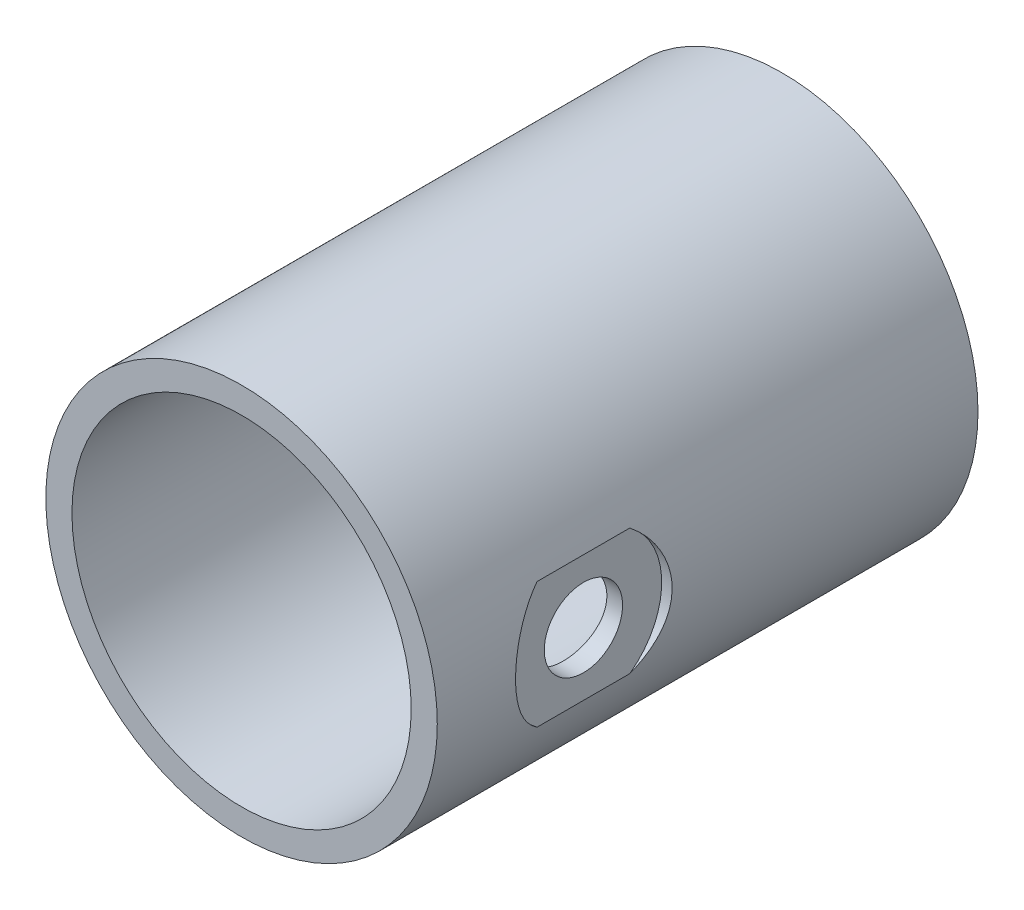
ISO-10303-21;
HEADER;
FILE_DESCRIPTION(('STEP AP214'),'2;1');
FILE_NAME('part.step','',(''),(''),'','','');
FILE_SCHEMA(('AUTOMOTIVE_DESIGN { 1 0 10303 214 1 1 1 1 }'));
ENDSEC;
DATA;
#1=APPLICATION_CONTEXT('core data for automotive mechanical design processes');
#2=APPLICATION_PROTOCOL_DEFINITION('international standard','automotive_design',2000,#1);
#3=PRODUCT_CONTEXT('',#1,'mechanical');
#4=PRODUCT('Part','Part','',(#3));
#5=PRODUCT_RELATED_PRODUCT_CATEGORY('part','',(#4));
#6=PRODUCT_DEFINITION_FORMATION('','',#4);
#7=PRODUCT_DEFINITION_CONTEXT('part definition',#1,'design');
#8=PRODUCT_DEFINITION('design','',#6,#7);
#9=PRODUCT_DEFINITION_SHAPE('','',#8);
#10=(LENGTH_UNIT() NAMED_UNIT(*) SI_UNIT(.MILLI.,.METRE.));
#11=(NAMED_UNIT(*) PLANE_ANGLE_UNIT() SI_UNIT($,.RADIAN.));
#12=(NAMED_UNIT(*) SI_UNIT($,.STERADIAN.) SOLID_ANGLE_UNIT());
#13=UNCERTAINTY_MEASURE_WITH_UNIT(LENGTH_MEASURE(1.E-05),#10,'distance_accuracy_value','');
#14=(GEOMETRIC_REPRESENTATION_CONTEXT(3) GLOBAL_UNCERTAINTY_ASSIGNED_CONTEXT((#13)) GLOBAL_UNIT_ASSIGNED_CONTEXT((#10,
#11,#12)) REPRESENTATION_CONTEXT('',''));
#15=CARTESIAN_POINT('',(0.,0.,0.));
#16=DIRECTION('',(0.,0.,1.));
#17=DIRECTION('',(1.,0.,0.));
#18=AXIS2_PLACEMENT_3D('',#15,#16,#17);
#19=CARTESIAN_POINT('',(0.,0.,263.144));
#20=DIRECTION('',(0.,0.,1.));
#21=DIRECTION('',(1.,0.,0.));
#22=AXIS2_PLACEMENT_3D('',#19,#20,#21);
#23=PLANE('',#22);
#24=CARTESIAN_POINT('',(0.,0.,263.144));
#25=DIRECTION('',(0.,0.,1.));
#26=DIRECTION('',(1.,0.,0.));
#27=AXIS2_PLACEMENT_3D('',#24,#25,#26);
#28=CIRCLE('',#27,95.25);
#29=CARTESIAN_POINT('',(95.25,0.,263.144));
#30=VERTEX_POINT('',#29);
#31=EDGE_CURVE('E75',#30,#30,#28,.T.);
#32=ORIENTED_EDGE('',*,*,#31,.T.);
#33=EDGE_LOOP('',(#32));
#34=FACE_BOUND('',#33,.T.);
#35=CARTESIAN_POINT('',(0.,0.,263.144));
#36=DIRECTION('',(0.,0.,1.));
#37=DIRECTION('',(1.,0.,0.));
#38=AXIS2_PLACEMENT_3D('',#35,#36,#37);
#39=CIRCLE('',#38,82.55);
#40=CARTESIAN_POINT('',(82.55,0.,263.144));
#41=VERTEX_POINT('',#40);
#42=EDGE_CURVE('E126',#41,#41,#39,.T.);
#43=ORIENTED_EDGE('',*,*,#42,.F.);
#44=EDGE_LOOP('',(#43));
#45=FACE_BOUND('',#44,.T.);
#46=ADVANCED_FACE('F35',(#34,#45),#23,.T.);
#47=CARTESIAN_POINT('',(0.,0.,0.));
#48=DIRECTION('',(0.,0.,1.));
#49=DIRECTION('',(1.,0.,0.));
#50=AXIS2_PLACEMENT_3D('',#47,#48,#49);
#51=PLANE('',#50);
#52=CARTESIAN_POINT('',(0.,0.,0.));
#53=DIRECTION('',(0.,0.,1.));
#54=DIRECTION('',(1.,0.,0.));
#55=AXIS2_PLACEMENT_3D('',#52,#53,#54);
#56=CIRCLE('',#55,95.25);
#57=CARTESIAN_POINT('',(95.25,0.,0.));
#58=VERTEX_POINT('',#57);
#59=EDGE_CURVE('E128',#58,#58,#56,.T.);
#60=ORIENTED_EDGE('',*,*,#59,.F.);
#61=EDGE_LOOP('',(#60));
#62=FACE_BOUND('',#61,.T.);
#63=CARTESIAN_POINT('',(0.,0.,0.));
#64=DIRECTION('',(0.,0.,1.));
#65=DIRECTION('',(1.,0.,0.));
#66=AXIS2_PLACEMENT_3D('',#63,#64,#65);
#67=CIRCLE('',#66,82.55);
#68=CARTESIAN_POINT('',(82.55,0.,0.));
#69=VERTEX_POINT('',#68);
#70=EDGE_CURVE('E71',#69,#69,#67,.T.);
#71=ORIENTED_EDGE('',*,*,#70,.T.);
#72=EDGE_LOOP('',(#71));
#73=FACE_BOUND('',#72,.T.);
#74=ADVANCED_FACE('F97',(#62,#73),#51,.F.);
#75=CARTESIAN_POINT('',(0.,0.,263.144));
#76=DIRECTION('',(0.,0.,-1.));
#77=DIRECTION('',(-1.,0.,0.));
#78=AXIS2_PLACEMENT_3D('',#75,#76,#77);
#79=CYLINDRICAL_SURFACE('',#78,95.25);
#80=DIRECTION('',(0.,0.,-1.));
#81=VECTOR('',#80,1.);
#82=CARTESIAN_POINT('',(90.17,-30.6909367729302,263.144));
#83=LINE('',#82,#81);
#84=CARTESIAN_POINT('',(90.17,-30.6909367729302,209.520013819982));
#85=VERTEX_POINT('',#84);
#86=CARTESIAN_POINT('',(90.17,-30.6909367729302,164.367986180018));
#87=VERTEX_POINT('',#86);
#88=EDGE_CURVE('E11',#85,#87,#83,.T.);
#89=ORIENTED_EDGE('',*,*,#88,.F.);
#90=CARTESIAN_POINT('',(90.17,-30.6909367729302,209.520013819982));
#91=CARTESIAN_POINT('',(90.3877588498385,-30.0512307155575,210.38972627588));
#92=CARTESIAN_POINT('',(90.6102774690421,-29.3750954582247,211.231389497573));
#93=CARTESIAN_POINT('',(91.0586055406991,-27.9543642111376,212.853951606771));
#94=CARTESIAN_POINT('',(91.2844151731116,-27.2097644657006,213.634847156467));
#95=CARTESIAN_POINT('',(91.7335438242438,-25.6549372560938,215.132687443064));
#96=CARTESIAN_POINT('',(91.9568565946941,-24.8445748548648,215.849494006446));
#97=CARTESIAN_POINT('',(92.3944188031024,-23.1643540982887,217.212678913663));
#98=CARTESIAN_POINT('',(92.6086684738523,-22.2944972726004,217.859059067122));
#99=CARTESIAN_POINT('',(93.0225428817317,-20.4992332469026,219.077625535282));
#100=CARTESIAN_POINT('',(93.2221482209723,-19.5737552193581,219.6497141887));
#101=CARTESIAN_POINT('',(93.6009112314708,-17.6739890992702,220.714187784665));
#102=CARTESIAN_POINT('',(93.7800686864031,-16.6997004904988,221.206571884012));
#103=CARTESIAN_POINT('',(94.1126811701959,-14.7099246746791,222.106750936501));
#104=CARTESIAN_POINT('',(94.2661657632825,-13.6944865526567,222.514643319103));
#105=CARTESIAN_POINT('',(94.5432361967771,-11.6286201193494,223.242545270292));
#106=CARTESIAN_POINT('',(94.6668235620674,-10.5781935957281,223.56255932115));
#107=CARTESIAN_POINT('',(94.876184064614,-8.49272824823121,224.100381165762));
#108=CARTESIAN_POINT('',(94.9632652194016,-7.45873793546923,224.321746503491));
#109=CARTESIAN_POINT('',(95.1040346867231,-5.37370167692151,224.677960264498));
#110=CARTESIAN_POINT('',(95.157723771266,-4.32265612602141,224.812810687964));
#111=CARTESIAN_POINT('',(95.2301723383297,-2.21179222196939,224.994495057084));
#112=CARTESIAN_POINT('',(95.2489321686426,-1.1519739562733,225.041329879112));
#113=CARTESIAN_POINT('',(95.2509788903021,0.967890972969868,225.046447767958));
#114=CARTESIAN_POINT('',(95.2342670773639,2.02793762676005,225.004734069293));
#115=CARTESIAN_POINT('',(95.1677705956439,4.08086510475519,224.838028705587));
#116=CARTESIAN_POINT('',(95.1198795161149,5.07419888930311,224.717803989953));
#117=CARTESIAN_POINT('',(94.9941384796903,7.04645131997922,224.400042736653));
#118=CARTESIAN_POINT('',(94.9162897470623,8.02537055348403,224.202509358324));
#119=CARTESIAN_POINT('',(94.7325895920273,9.96219641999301,223.73201273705));
#120=CARTESIAN_POINT('',(94.6267380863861,10.9201029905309,223.4590492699));
#121=CARTESIAN_POINT('',(94.3896364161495,12.8087859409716,222.84013653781));
#122=CARTESIAN_POINT('',(94.2583858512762,13.739561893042,222.49418612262));
#123=CARTESIAN_POINT('',(93.9713970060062,15.5827684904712,221.726176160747));
#124=CARTESIAN_POINT('',(93.8153064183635,16.4946812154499,221.303006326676));
#125=CARTESIAN_POINT('',(93.4839288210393,18.2795402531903,220.387600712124));
#126=CARTESIAN_POINT('',(93.3086407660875,19.1524844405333,219.895361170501));
#127=CARTESIAN_POINT('',(92.9430074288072,20.8546842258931,218.845290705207));
#128=CARTESIAN_POINT('',(92.7526613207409,21.6839374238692,218.28745618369));
#129=CARTESIAN_POINT('',(92.3613573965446,23.2943915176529,217.109810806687));
#130=CARTESIAN_POINT('',(92.1604012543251,24.0755999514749,216.490009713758));
#131=CARTESIAN_POINT('',(91.8088338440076,25.3775794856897,215.371246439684));
#132=CARTESIAN_POINT('',(91.6596349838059,25.9107232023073,214.886145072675));
#133=CARTESIAN_POINT('',(91.3599175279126,26.9484614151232,213.886703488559));
#134=CARTESIAN_POINT('',(91.2093990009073,27.4530573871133,213.372364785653));
#135=CARTESIAN_POINT('',(90.9091996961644,28.4313412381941,212.316928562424));
#136=CARTESIAN_POINT('',(90.7595178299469,28.9050908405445,211.775888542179));
#137=CARTESIAN_POINT('',(90.4625153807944,29.8216039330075,210.667392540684));
#138=CARTESIAN_POINT('',(90.3151952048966,30.2643621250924,210.099932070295));
#139=CARTESIAN_POINT('',(90.17,30.6909367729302,209.520013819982));
#140=B_SPLINE_CURVE_WITH_KNOTS('',3,(#90,#91,#92,#93,#94,#95,#96,#97,#98,#99,#100,#101,#102,
#103,#104,#105,#106,#107,#108,#109,#110,#111,#112,#113,#114,#115,#116,#117,#118,#119,#120,#121,
#122,#123,#124,#125,#126,#127,#128,#129,#130,#131,#132,#133,#134,#135,#136,#137,#138,#139),
.UNSPECIFIED.,.F.,.F.,(4,2,2,2,2,2,2,2,2,2,2,2,2,2,2,2,2,2,2,2,2,2,2,2,4),(0.,3.30311891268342,
6.60641912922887,9.9166775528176,13.2268508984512,16.5413325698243,19.8558493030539,
23.1665224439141,26.4770266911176,29.6559173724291,32.8347345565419,36.0135200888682,
39.192189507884,42.1938449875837,45.1953778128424,48.1969195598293,51.1985086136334,
54.2472523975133,57.296162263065,60.3452394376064,63.3938369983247,65.6010438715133,
67.808136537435,70.0106677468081,72.2135745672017),.UNSPECIFIED.);
#141=CARTESIAN_POINT('',(90.17,30.6909367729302,209.520013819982));
#142=VERTEX_POINT('',#141);
#143=EDGE_CURVE('E68',#85,#142,#140,.T.);
#144=ORIENTED_EDGE('',*,*,#143,.T.);
#145=DIRECTION('',(0.,0.,-1.));
#146=VECTOR('',#145,1.);
#147=CARTESIAN_POINT('',(90.17,30.6909367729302,263.144));
#148=LINE('',#147,#146);
#149=CARTESIAN_POINT('',(90.17,30.6909367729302,164.367986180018));
#150=VERTEX_POINT('',#149);
#151=EDGE_CURVE('E44',#150,#142,#148,.F.);
#152=ORIENTED_EDGE('',*,*,#151,.F.);
#153=CARTESIAN_POINT('',(90.17,30.6909367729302,164.367986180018));
#154=CARTESIAN_POINT('',(90.3877588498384,30.0512307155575,163.49827372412));
#155=CARTESIAN_POINT('',(90.610277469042,29.3750954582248,162.656610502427));
#156=CARTESIAN_POINT('',(91.058605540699,27.9543642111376,161.034048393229));
#157=CARTESIAN_POINT('',(91.2844151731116,27.2097644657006,160.253152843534));
#158=CARTESIAN_POINT('',(91.7335438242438,25.6549372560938,158.755312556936));
#159=CARTESIAN_POINT('',(91.9568565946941,24.8445748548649,158.038505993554));
#160=CARTESIAN_POINT('',(92.3944188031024,23.1643540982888,156.675321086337));
#161=CARTESIAN_POINT('',(92.6086684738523,22.2944972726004,156.028940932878));
#162=CARTESIAN_POINT('',(93.0225428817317,20.4992332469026,154.810374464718));
#163=CARTESIAN_POINT('',(93.2221482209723,19.5737552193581,154.2382858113));
#164=CARTESIAN_POINT('',(93.6009112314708,17.6739890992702,153.173812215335));
#165=CARTESIAN_POINT('',(93.7800686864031,16.6997004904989,152.681428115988));
#166=CARTESIAN_POINT('',(94.1126811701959,14.7099246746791,151.7812490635));
#167=CARTESIAN_POINT('',(94.2661657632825,13.6944865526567,151.373356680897));
#168=CARTESIAN_POINT('',(94.543236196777,11.6286201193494,150.645454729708));
#169=CARTESIAN_POINT('',(94.6668235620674,10.5781935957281,150.32544067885));
#170=CARTESIAN_POINT('',(94.876184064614,8.49272824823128,149.787618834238));
#171=CARTESIAN_POINT('',(94.9632652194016,7.4587379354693,149.566253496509));
#172=CARTESIAN_POINT('',(95.1040346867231,5.37370167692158,149.210039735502));
#173=CARTESIAN_POINT('',(95.157723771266,4.32265612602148,149.075189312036));
#174=CARTESIAN_POINT('',(95.2301723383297,2.21179222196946,148.893504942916));
#175=CARTESIAN_POINT('',(95.2489321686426,1.15197395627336,148.846670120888));
#176=CARTESIAN_POINT('',(95.2509788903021,-0.967890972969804,148.841552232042));
#177=CARTESIAN_POINT('',(95.2342670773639,-2.02793762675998,148.883265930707));
#178=CARTESIAN_POINT('',(95.1677705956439,-4.08086510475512,149.049971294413));
#179=CARTESIAN_POINT('',(95.1198795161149,-5.07419888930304,149.170196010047));
#180=CARTESIAN_POINT('',(94.9941384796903,-7.04645131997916,149.487957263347));
#181=CARTESIAN_POINT('',(94.9162897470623,-8.02537055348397,149.685490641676));
#182=CARTESIAN_POINT('',(94.7325895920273,-9.96219641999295,150.15598726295));
#183=CARTESIAN_POINT('',(94.6267380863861,-10.9201029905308,150.4289507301));
#184=CARTESIAN_POINT('',(94.3896364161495,-12.8087859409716,151.04786346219));
#185=CARTESIAN_POINT('',(94.2583858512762,-13.7395618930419,151.39381387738));
#186=CARTESIAN_POINT('',(93.9713970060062,-15.5827684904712,152.161823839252));
#187=CARTESIAN_POINT('',(93.8153064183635,-16.4946812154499,152.584993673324));
#188=CARTESIAN_POINT('',(93.4839288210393,-18.2795402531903,153.500399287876));
#189=CARTESIAN_POINT('',(93.3086407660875,-19.1524844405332,153.992638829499));
#190=CARTESIAN_POINT('',(92.9430074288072,-20.8546842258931,155.042709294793));
#191=CARTESIAN_POINT('',(92.7526613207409,-21.6839374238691,155.60054381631));
#192=CARTESIAN_POINT('',(92.3613573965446,-23.2943915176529,156.778189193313));
#193=CARTESIAN_POINT('',(92.1604012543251,-24.0755999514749,157.397990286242));
#194=CARTESIAN_POINT('',(91.8088338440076,-25.3775794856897,158.516753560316));
#195=CARTESIAN_POINT('',(91.659634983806,-25.9107232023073,159.001854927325));
#196=CARTESIAN_POINT('',(91.3599175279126,-26.9484614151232,160.001296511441));
#197=CARTESIAN_POINT('',(91.2093990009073,-27.4530573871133,160.515635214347));
#198=CARTESIAN_POINT('',(90.9091996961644,-28.4313412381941,161.571071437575));
#199=CARTESIAN_POINT('',(90.7595178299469,-28.9050908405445,162.112111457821));
#200=CARTESIAN_POINT('',(90.4625153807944,-29.8216039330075,163.220607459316));
#201=CARTESIAN_POINT('',(90.3151952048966,-30.2643621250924,163.788067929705));
#202=CARTESIAN_POINT('',(90.17,-30.6909367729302,164.367986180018));
#203=B_SPLINE_CURVE_WITH_KNOTS('',3,(#153,#154,#155,#156,#157,#158,#159,#160,#161,#162,#163,
#164,#165,#166,#167,#168,#169,#170,#171,#172,#173,#174,#175,#176,#177,#178,#179,#180,#181,#182,
#183,#184,#185,#186,#187,#188,#189,#190,#191,#192,#193,#194,#195,#196,#197,#198,#199,#200,#201,
#202),.UNSPECIFIED.,.F.,.F.,(4,2,2,2,2,2,2,2,2,2,2,2,2,2,2,2,2,2,2,2,2,2,2,2,4),(0.,
3.30311891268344,6.60641912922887,9.91667755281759,13.2268508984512,16.5413325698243,
19.8558493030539,23.1665224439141,26.4770266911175,29.6559173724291,32.8347345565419,
36.0135200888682,39.192189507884,42.1938449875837,45.1953778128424,48.1969195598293,
51.1985086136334,54.2472523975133,57.296162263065,60.3452394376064,63.3938369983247,
65.6010438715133,67.808136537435,70.0106677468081,72.2135745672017),.UNSPECIFIED.);
#204=EDGE_CURVE('E50',#150,#87,#203,.T.);
#205=ORIENTED_EDGE('',*,*,#204,.T.);
#206=EDGE_LOOP('',(#89,#144,#152,#205));
#207=FACE_BOUND('',#206,.T.);
#208=ORIENTED_EDGE('',*,*,#31,.F.);
#209=EDGE_LOOP('',(#208));
#210=FACE_BOUND('',#209,.T.);
#211=ORIENTED_EDGE('',*,*,#59,.T.);
#212=EDGE_LOOP('',(#211));
#213=FACE_BOUND('',#212,.T.);
#214=ADVANCED_FACE('F37',(#207,#210,#213),#79,.T.);
#215=CARTESIAN_POINT('',(0.,0.,263.144));
#216=DIRECTION('',(0.,0.,-1.));
#217=DIRECTION('',(-1.,0.,0.));
#218=AXIS2_PLACEMENT_3D('',#215,#216,#217);
#219=CYLINDRICAL_SURFACE('',#218,82.55);
#220=CARTESIAN_POINT('',(80.3218525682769,19.05,186.944));
#221=CARTESIAN_POINT('',(80.3218540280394,19.0499974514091,186.416625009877));
#222=CARTESIAN_POINT('',(80.3270606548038,19.0280817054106,185.889196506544));
#223=CARTESIAN_POINT('',(80.3477345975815,18.9405918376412,184.838134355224));
#224=CARTESIAN_POINT('',(80.3632033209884,18.875011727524,184.314501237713));
#225=CARTESIAN_POINT('',(80.4039482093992,18.700685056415,183.274529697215));
#226=CARTESIAN_POINT('',(80.429230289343,18.5919124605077,182.758195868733));
#227=CARTESIAN_POINT('',(80.4888477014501,18.3320929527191,181.736837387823));
#228=CARTESIAN_POINT('',(80.5231827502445,18.1810473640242,181.231812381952));
#229=CARTESIAN_POINT('',(80.5998530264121,17.8380773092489,180.237143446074));
#230=CARTESIAN_POINT('',(80.6421787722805,17.6462012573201,179.747482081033));
#231=CARTESIAN_POINT('',(80.7336387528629,17.2229185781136,178.786219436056));
#232=CARTESIAN_POINT('',(80.7827730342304,16.9915116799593,178.314618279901));
#233=CARTESIAN_POINT('',(80.8864601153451,16.4908576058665,177.392596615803));
#234=CARTESIAN_POINT('',(80.941012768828,16.2216114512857,176.942175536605));
#235=CARTESIAN_POINT('',(81.0540239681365,15.6471518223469,176.065404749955));
#236=CARTESIAN_POINT('',(81.1124825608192,15.3419379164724,175.639055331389));
#237=CARTESIAN_POINT('',(81.2327169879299,14.6921462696,174.806166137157));
#238=CARTESIAN_POINT('',(81.2945321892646,14.3469904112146,174.400082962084));
#239=CARTESIAN_POINT('',(81.4188265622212,13.6239388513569,173.618299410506));
#240=CARTESIAN_POINT('',(81.4813057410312,13.2460427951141,173.242599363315));
#241=CARTESIAN_POINT('',(81.6052052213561,12.4599865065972,172.524055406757));
#242=CARTESIAN_POINT('',(81.6666254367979,12.0518238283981,172.181214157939));
#243=CARTESIAN_POINT('',(81.7867100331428,11.2079509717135,171.530754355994));
#244=CARTESIAN_POINT('',(81.8453744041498,10.772240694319,171.223135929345));
#245=CARTESIAN_POINT('',(81.9589979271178,9.87086063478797,170.64186597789));
#246=CARTESIAN_POINT('',(82.0139051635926,9.40489790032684,170.368658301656));
#247=CARTESIAN_POINT('',(82.11768773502,8.45091943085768,169.862547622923));
#248=CARTESIAN_POINT('',(82.166563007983,7.96290346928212,169.629645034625));
#249=CARTESIAN_POINT('',(82.2568820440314,6.96829599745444,169.205975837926));
#250=CARTESIAN_POINT('',(82.298326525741,6.46170628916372,169.015205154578));
#251=CARTESIAN_POINT('',(82.3725958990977,5.43355780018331,168.677315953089));
#252=CARTESIAN_POINT('',(82.4054209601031,4.91199931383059,168.53019657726));
#253=CARTESIAN_POINT('',(82.4610118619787,3.86691933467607,168.283005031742));
#254=CARTESIAN_POINT('',(82.4839425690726,3.34358939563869,168.182159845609));
#255=CARTESIAN_POINT('',(82.5199144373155,2.28998611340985,168.024640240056));
#256=CARTESIAN_POINT('',(82.5329557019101,1.75971284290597,167.967965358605));
#257=CARTESIAN_POINT('',(82.5487772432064,0.696187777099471,167.899269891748));
#258=CARTESIAN_POINT('',(82.551558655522,0.162936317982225,167.887244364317));
#259=CARTESIAN_POINT('',(82.5467842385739,-0.9026481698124,167.907937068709));
#260=CARTESIAN_POINT('',(82.5392285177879,-1.43498120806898,167.940654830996));
#261=CARTESIAN_POINT('',(82.5142353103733,-2.48473534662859,168.049509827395));
#262=CARTESIAN_POINT('',(82.4969878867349,-3.00224781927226,168.124812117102));
#263=CARTESIAN_POINT('',(82.4532236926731,-4.02894695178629,168.317596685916));
#264=CARTESIAN_POINT('',(82.4267070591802,-4.53813373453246,168.435078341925));
#265=CARTESIAN_POINT('',(82.3651223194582,-5.54467193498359,168.711296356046));
#266=CARTESIAN_POINT('',(82.3300539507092,-6.04202298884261,168.870033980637));
#267=CARTESIAN_POINT('',(82.2523090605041,-7.02150584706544,169.227545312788));
#268=CARTESIAN_POINT('',(82.2096324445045,-7.50363746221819,169.426319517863));
#269=CARTESIAN_POINT('',(82.1174428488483,-8.45325259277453,169.86417078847));
#270=CARTESIAN_POINT('',(82.0678781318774,-8.92058887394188,170.103556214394));
#271=CARTESIAN_POINT('',(81.9635061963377,-9.83347616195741,170.619778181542));
#272=CARTESIAN_POINT('',(81.908698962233,-10.2790271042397,170.896614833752));
#273=CARTESIAN_POINT('',(81.7952979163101,-11.1455243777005,171.485852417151));
#274=CARTESIAN_POINT('',(81.7367036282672,-11.5664676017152,171.798257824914));
#275=CARTESIAN_POINT('',(81.6172938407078,-12.3810063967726,172.456509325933));
#276=CARTESIAN_POINT('',(81.5564783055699,-12.7746015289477,172.802355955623));
#277=CARTESIAN_POINT('',(81.4328303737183,-13.5407045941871,173.533605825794));
#278=CARTESIAN_POINT('',(81.3699838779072,-13.9125134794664,173.919739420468));
#279=CARTESIAN_POINT('',(81.2454227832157,-14.6223689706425,174.722063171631));
#280=CARTESIAN_POINT('',(81.1837082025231,-14.9604150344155,175.138253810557));
#281=CARTESIAN_POINT('',(81.0631560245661,-15.6004267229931,175.997934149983));
#282=CARTESIAN_POINT('',(81.0043185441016,-15.9023908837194,176.441424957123));
#283=CARTESIAN_POINT('',(80.8912127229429,-16.4680733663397,177.352719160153));
#284=CARTESIAN_POINT('',(80.8369443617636,-16.7317918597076,177.820522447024));
#285=CARTESIAN_POINT('',(80.7343747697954,-17.219921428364,178.779008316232));
#286=CARTESIAN_POINT('',(80.6860959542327,-17.4441860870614,179.269767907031));
#287=CARTESIAN_POINT('',(80.5971833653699,-17.8504850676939,180.269148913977));
#288=CARTESIAN_POINT('',(80.55654963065,-18.032519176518,180.777770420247));
#289=CARTESIAN_POINT('',(80.4841734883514,-18.3528555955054,181.80914544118));
#290=CARTESIAN_POINT('',(80.452429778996,-18.4911643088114,182.331896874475));
#291=CARTESIAN_POINT('',(80.3988121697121,-18.7229185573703,183.38774732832));
#292=CARTESIAN_POINT('',(80.3769380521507,-18.8163650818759,183.920846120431));
#293=CARTESIAN_POINT('',(80.3441223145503,-18.9559893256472,184.981234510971));
#294=CARTESIAN_POINT('',(80.3329444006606,-19.0031892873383,185.508382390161));
#295=CARTESIAN_POINT('',(80.3210105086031,-19.0535679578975,186.564892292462));
#296=CARTESIAN_POINT('',(80.3202543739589,-19.0567473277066,187.094254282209));
#297=CARTESIAN_POINT('',(80.3291866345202,-19.0190600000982,188.15127889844));
#298=CARTESIAN_POINT('',(80.338874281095,-18.9781964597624,188.67894164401));
#299=CARTESIAN_POINT('',(80.3683989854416,-18.8527739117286,189.728757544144));
#300=CARTESIAN_POINT('',(80.3882360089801,-18.7682150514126,190.250910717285));
#301=CARTESIAN_POINT('',(80.4371291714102,-18.5575390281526,191.278956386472));
#302=CARTESIAN_POINT('',(80.4660573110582,-18.4319979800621,191.784973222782));
#303=CARTESIAN_POINT('',(80.5323710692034,-18.1400686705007,192.784503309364));
#304=CARTESIAN_POINT('',(80.5697565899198,-17.9736808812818,193.278016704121));
#305=CARTESIAN_POINT('',(80.6519236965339,-17.6013076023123,194.249271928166));
#306=CARTESIAN_POINT('',(80.696705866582,-17.3953189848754,194.727012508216));
#307=CARTESIAN_POINT('',(80.7924113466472,-16.9452550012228,195.663562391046));
#308=CARTESIAN_POINT('',(80.84333476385,-16.7011789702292,196.122371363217));
#309=CARTESIAN_POINT('',(80.9508288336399,-16.1721939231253,197.025728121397));
#310=CARTESIAN_POINT('',(81.0074806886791,-15.8866619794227,197.469901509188));
#311=CARTESIAN_POINT('',(81.1241062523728,-15.2799630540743,198.332739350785));
#312=CARTESIAN_POINT('',(81.1840799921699,-14.9587957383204,198.751403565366));
#313=CARTESIAN_POINT('',(81.3057058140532,-14.2829468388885,199.560570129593));
#314=CARTESIAN_POINT('',(81.3673580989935,-13.9282611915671,199.951069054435));
#315=CARTESIAN_POINT('',(81.4906557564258,-13.1877363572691,200.701322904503));
#316=CARTESIAN_POINT('',(81.5523011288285,-12.80189680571,201.061077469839));
#317=CARTESIAN_POINT('',(81.6751952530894,-11.9931530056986,201.75468820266));
#318=CARTESIAN_POINT('',(81.736408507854,-11.5696406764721,202.087842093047));
#319=CARTESIAN_POINT('',(81.85536842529,-10.6955905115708,202.717296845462));
#320=CARTESIAN_POINT('',(81.9131150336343,-10.2450522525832,203.013597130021));
#321=CARTESIAN_POINT('',(82.0235119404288,-9.32002726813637,203.567179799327));
#322=CARTESIAN_POINT('',(82.0761623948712,-8.84554127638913,203.824463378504));
#323=CARTESIAN_POINT('',(82.1748761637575,-7.87589204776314,204.29807572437));
#324=CARTESIAN_POINT('',(82.2209395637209,-7.3807290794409,204.514405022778));
#325=CARTESIAN_POINT('',(82.3048767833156,-6.37666048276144,204.90307915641));
#326=CARTESIAN_POINT('',(82.3428043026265,-5.86787158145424,205.075713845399));
#327=CARTESIAN_POINT('',(82.409786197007,-4.83698356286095,205.377516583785));
#328=CARTESIAN_POINT('',(82.4388405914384,-4.31488447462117,205.506684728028));
#329=CARTESIAN_POINT('',(82.4872395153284,-3.26126895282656,205.720462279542));
#330=CARTESIAN_POINT('',(82.5065853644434,-2.72975380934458,205.805077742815));
#331=CARTESIAN_POINT('',(82.5350139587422,-1.66120199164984,205.929051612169));
#332=CARTESIAN_POINT('',(82.544096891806,-1.12416541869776,205.968410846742));
#333=CARTESIAN_POINT('',(82.5516492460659,-0.0610604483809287,206.001151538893));
#334=CARTESIAN_POINT('',(82.5503592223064,0.46497443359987,205.995575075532));
#335=CARTESIAN_POINT('',(82.5377719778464,1.51465604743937,205.940960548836));
#336=CARTESIAN_POINT('',(82.526474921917,2.03830281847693,205.891923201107));
#337=CARTESIAN_POINT('',(82.4941865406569,3.07943989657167,205.750794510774));
#338=CARTESIAN_POINT('',(82.4731954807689,3.59693037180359,205.658704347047));
#339=CARTESIAN_POINT('',(82.4220968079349,4.62210734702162,205.432217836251));
#340=CARTESIAN_POINT('',(82.3919891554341,5.1297938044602,205.297821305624));
#341=CARTESIAN_POINT('',(82.3236167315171,6.12983234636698,204.988404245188));
#342=CARTESIAN_POINT('',(82.2853849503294,6.62223748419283,204.813547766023));
#343=CARTESIAN_POINT('',(82.2017213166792,7.59049877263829,204.424248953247));
#344=CARTESIAN_POINT('',(82.1562895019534,8.06635500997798,204.209806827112));
#345=CARTESIAN_POINT('',(82.0594318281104,8.99842943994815,203.742883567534));
#346=CARTESIAN_POINT('',(82.0080054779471,9.45464601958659,203.49039931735));
#347=CARTESIAN_POINT('',(81.9005210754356,10.3444681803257,202.949176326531));
#348=CARTESIAN_POINT('',(81.8444629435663,10.7780733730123,202.660436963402));
#349=CARTESIAN_POINT('',(81.7279855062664,11.6287155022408,202.042266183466));
#350=CARTESIAN_POINT('',(81.6674995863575,12.0452175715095,201.712111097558));
#351=CARTESIAN_POINT('',(81.5448921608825,12.8490624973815,201.018302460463));
#352=CARTESIAN_POINT('',(81.4827706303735,13.2364049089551,200.654648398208));
#353=CARTESIAN_POINT('',(81.3585817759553,13.979471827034,199.896173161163));
#354=CARTESIAN_POINT('',(81.2965144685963,14.3351887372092,199.501344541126));
#355=CARTESIAN_POINT('',(81.1741650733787,15.0125247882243,198.683192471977));
#356=CARTESIAN_POINT('',(81.1138829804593,15.3341440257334,198.259869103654));
#357=CARTESIAN_POINT('',(80.9958936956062,15.945726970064,197.380825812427));
#358=CARTESIAN_POINT('',(80.9382399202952,16.2351319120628,196.924709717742));
#359=CARTESIAN_POINT('',(80.8281941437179,16.7744244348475,195.989040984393));
#360=CARTESIAN_POINT('',(80.7758024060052,17.0243100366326,195.509487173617));
#361=CARTESIAN_POINT('',(80.677880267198,17.4824769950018,194.530653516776));
#362=CARTESIAN_POINT('',(80.6323449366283,17.6907882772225,194.031388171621));
#363=CARTESIAN_POINT('',(80.5494773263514,18.0643536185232,193.016392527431));
#364=CARTESIAN_POINT('',(80.5121436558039,18.2296149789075,192.500665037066));
#365=CARTESIAN_POINT('',(80.4538972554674,18.4847518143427,191.569621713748));
#366=CARTESIAN_POINT('',(80.4311792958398,18.5832023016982,191.1567445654));
#367=CARTESIAN_POINT('',(80.3919040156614,18.7523822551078,190.324945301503));
#368=CARTESIAN_POINT('',(80.375348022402,18.8231057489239,189.906021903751));
#369=CARTESIAN_POINT('',(80.3487291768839,18.9364097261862,189.064201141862));
#370=CARTESIAN_POINT('',(80.338666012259,18.978991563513,188.641303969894));
#371=CARTESIAN_POINT('',(80.3252278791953,19.0357845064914,187.793615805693));
#372=CARTESIAN_POINT('',(80.3218513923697,19.0500020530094,187.368825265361));
#373=CARTESIAN_POINT('',(80.3218525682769,19.05,186.944));
#374=B_SPLINE_CURVE_WITH_KNOTS('',3,(#220,#221,#222,#223,#224,#225,#226,#227,#228,#229,#230,
#231,#232,#233,#234,#235,#236,#237,#238,#239,#240,#241,#242,#243,#244,#245,#246,#247,#248,#249,
#250,#251,#252,#253,#254,#255,#256,#257,#258,#259,#260,#261,#262,#263,#264,#265,#266,#267,#268,
#269,#270,#271,#272,#273,#274,#275,#276,#277,#278,#279,#280,#281,#282,#283,#284,#285,#286,#287,
#288,#289,#290,#291,#292,#293,#294,#295,#296,#297,#298,#299,#300,#301,#302,#303,#304,#305,#306,
#307,#308,#309,#310,#311,#312,#313,#314,#315,#316,#317,#318,#319,#320,#321,#322,#323,#324,#325,
#326,#327,#328,#329,#330,#331,#332,#333,#334,#335,#336,#337,#338,#339,#340,#341,#342,#343,#344,
#345,#346,#347,#348,#349,#350,#351,#352,#353,#354,#355,#356,#357,#358,#359,#360,#361,#362,#363,
#364,#365,#366,#367,#368,#369,#370,#371,#372,#373),.UNSPECIFIED.,.T.,.F.,(4,2,2,2,2,2,2,2,2,2,2,
2,2,2,2,2,2,2,2,2,2,2,2,2,2,2,2,2,2,2,2,2,2,2,2,2,2,2,2,2,2,2,2,2,2,2,2,2,2,2,2,2,2,2,2,2,2,2,2,
2,2,2,2,2,2,2,2,2,2,2,2,2,2,2,2,2,4),(0.,1.58173838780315,3.16369374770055,4.7466041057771,
6.32946492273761,7.91045923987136,9.49146439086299,11.0724268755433,12.65340832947,
14.2611105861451,15.8688302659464,17.4766800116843,19.0845355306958,20.7113717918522,
22.3382247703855,23.9649203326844,25.5915839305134,27.1899848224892,28.7883689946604,
30.3865762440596,31.9847667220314,33.552657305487,35.1205247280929,36.6884402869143,
38.2563753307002,39.8367972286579,41.4172238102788,42.997849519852,44.5785005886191,
46.1957414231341,47.8130082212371,49.4303406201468,51.0476657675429,52.6708718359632,
54.2940860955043,55.9170625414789,57.5400031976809,59.1262014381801,60.7123758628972,
62.2984365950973,63.8844919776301,65.4491476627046,67.0137852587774,68.578546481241,
70.1433350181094,71.7346915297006,73.3260629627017,74.917627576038,76.5092108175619,
78.1342079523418,79.7592305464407,81.3842033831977,83.0091551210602,84.6230269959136,
86.236895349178,87.8505442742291,89.4641636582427,91.0404720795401,92.6167545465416,
94.1929938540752,95.7692400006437,97.3392036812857,98.9091591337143,100.479243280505,
102.049354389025,103.65224404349,105.255158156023,106.85845624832,108.461749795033,
110.089540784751,111.717413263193,113.344109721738,114.970530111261,116.244770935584,
117.519286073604,118.793739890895,120.067904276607),.UNSPECIFIED.);
#375=CARTESIAN_POINT('',(80.3218525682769,19.05,186.944));
#376=VERTEX_POINT('',#375);
#377=EDGE_CURVE('E99',#376,#376,#374,.T.);
#378=ORIENTED_EDGE('',*,*,#377,.F.);
#379=EDGE_LOOP('',(#378));
#380=FACE_BOUND('',#379,.T.);
#381=ORIENTED_EDGE('',*,*,#42,.T.);
#382=EDGE_LOOP('',(#381));
#383=FACE_BOUND('',#382,.T.);
#384=ORIENTED_EDGE('',*,*,#70,.F.);
#385=EDGE_LOOP('',(#384));
#386=FACE_BOUND('',#385,.T.);
#387=ADVANCED_FACE('F90',(#380,#383,#386),#219,.F.);
#388=CARTESIAN_POINT('',(90.17,0.,186.944));
#389=DIRECTION('',(1.,0.,0.));
#390=DIRECTION('',(0.,1.,0.));
#391=AXIS2_PLACEMENT_3D('',#388,#389,#390);
#392=CYLINDRICAL_SURFACE('',#391,38.1);
#393=CARTESIAN_POINT('',(90.17,0.,186.944));
#394=DIRECTION('',(1.,0.,0.));
#395=DIRECTION('',(0.,1.,0.));
#396=AXIS2_PLACEMENT_3D('',#393,#394,#395);
#397=CIRCLE('',#396,38.1);
#398=EDGE_CURVE('E64',#142,#85,#397,.T.);
#399=ORIENTED_EDGE('',*,*,#398,.F.);
#400=ORIENTED_EDGE('',*,*,#143,.F.);
#401=EDGE_LOOP('',(#399,#400));
#402=FACE_BOUND('',#401,.T.);
#403=ADVANCED_FACE('F70',(#402),#392,.F.);
#404=EDGE_CURVE('E65',#87,#150,#397,.T.);
#405=ORIENTED_EDGE('',*,*,#404,.F.);
#406=ORIENTED_EDGE('',*,*,#204,.F.);
#407=EDGE_LOOP('',(#405,#406));
#408=FACE_BOUND('',#407,.T.);
#409=ADVANCED_FACE('F89',(#408),#392,.F.);
#410=CARTESIAN_POINT('',(90.17,0.,186.944));
#411=DIRECTION('',(1.,0.,0.));
#412=DIRECTION('',(0.,1.,0.));
#413=AXIS2_PLACEMENT_3D('',#410,#411,#412);
#414=PLANE('',#413);
#415=CARTESIAN_POINT('',(90.17,0.,186.944));
#416=DIRECTION('',(1.,0.,0.));
#417=DIRECTION('',(0.,1.,0.));
#418=AXIS2_PLACEMENT_3D('',#415,#416,#417);
#419=CIRCLE('',#418,19.05);
#420=CARTESIAN_POINT('',(90.17,19.05,186.944));
#421=VERTEX_POINT('',#420);
#422=EDGE_CURVE('E104',#421,#421,#419,.T.);
#423=ORIENTED_EDGE('',*,*,#422,.F.);
#424=EDGE_LOOP('',(#423));
#425=FACE_BOUND('',#424,.T.);
#426=ORIENTED_EDGE('',*,*,#88,.T.);
#427=ORIENTED_EDGE('',*,*,#404,.T.);
#428=ORIENTED_EDGE('',*,*,#151,.T.);
#429=ORIENTED_EDGE('',*,*,#398,.T.);
#430=EDGE_LOOP('',(#426,#427,#428,#429));
#431=FACE_BOUND('',#430,.T.);
#432=ADVANCED_FACE('F63',(#425,#431),#414,.T.);
#433=CARTESIAN_POINT('',(64.77,0.,186.944));
#434=DIRECTION('',(1.,0.,0.));
#435=DIRECTION('',(0.,1.,0.));
#436=AXIS2_PLACEMENT_3D('',#433,#434,#435);
#437=CYLINDRICAL_SURFACE('',#436,19.05);
#438=ORIENTED_EDGE('',*,*,#377,.T.);
#439=EDGE_LOOP('',(#438));
#440=FACE_BOUND('',#439,.T.);
#441=ORIENTED_EDGE('',*,*,#422,.T.);
#442=EDGE_LOOP('',(#441));
#443=FACE_BOUND('',#442,.T.);
#444=ADVANCED_FACE('F106',(#440,#443),#437,.F.);
#445=CLOSED_SHELL('',(#46,#74,#214,#387,#403,#409,#432,#444));
#446=MANIFOLD_SOLID_BREP('B2',#445);
#447=ADVANCED_BREP_SHAPE_REPRESENTATION('',(#18,#446),#14);
#448=SHAPE_DEFINITION_REPRESENTATION(#9,#447);
ENDSEC;
END-ISO-10303-21;
